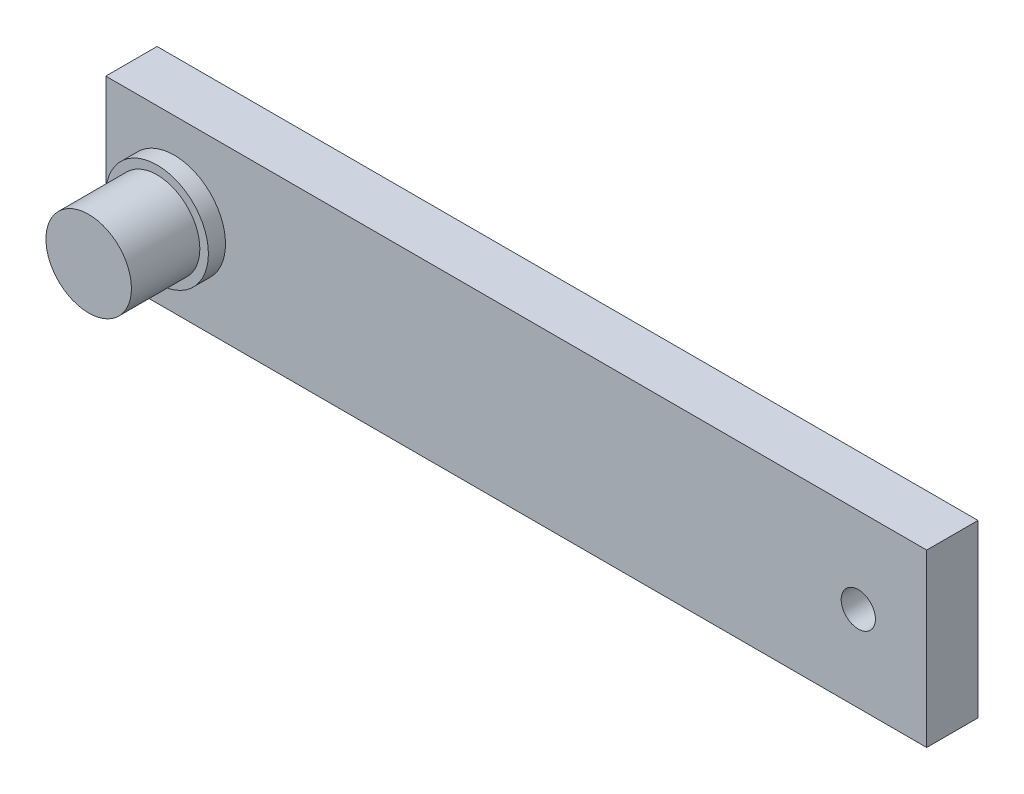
from build123d import *

# Parameters (mm, degrees)
SKETCH_1_W          = 480
SKETCH_1_H          = 100
EXTRUDE_1_DEPTH     = 30
SKETCH_2_R          = 30
EXTRUDE_2_DEPTH     = 10
SKETCH_3_R          = 25
EXTRUDE_3_DEPTH     = 40
SKETCH_4_R          = 10
CUT_EXTRUDE_4_DEPTH = 493.848861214


with BuildPart() as part:
    # Sketch 1 → Extrude 1 (new body)
    with BuildSketch(Plane.XY):
        with Locations((240, 50)):
            Rectangle(SKETCH_1_W, SKETCH_1_H)
    extrude(amount=EXTRUDE_1_DEPTH)

    # Sketch 2 → Extrude 2 (add)
    with BuildSketch(Plane.XY.offset(30)):
        with Locations(Location((40, 50, 0), (0, 0, 180))):
            Circle(SKETCH_2_R)
    extrude(amount=EXTRUDE_2_DEPTH)

    # Sketch 3 → Extrude 3 (add)
    with BuildSketch(Plane.XY.offset(40)):
        with Locations((40, 50)):
            Circle(SKETCH_3_R)
    extrude(amount=EXTRUDE_3_DEPTH)

    # Sketch 4 → Cut-Extrude 4 (cut, through all)
    with BuildSketch(Plane.XY.offset(30)):
        with Locations((440, 50)):
            Circle(SKETCH_4_R)
    extrude(amount=-CUT_EXTRUDE_4_DEPTH, mode=Mode.SUBTRACT)


solid = part.part
